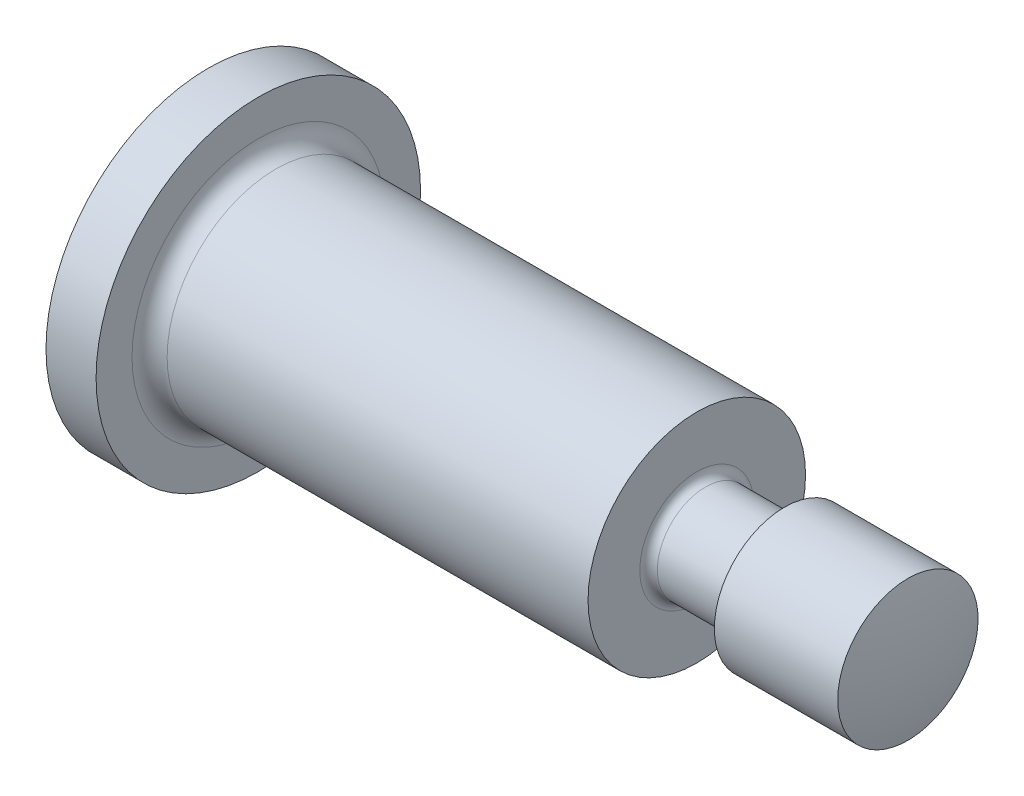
from build123d import *

# Parameters (mm, degrees)
SKETCH1_R       = 1.85
BASEHEAD_DEPTH  = 1.1
SKETCH2_R       = 1.24
BASEBODY_DEPTH  = 5
SKETCH3_R       = 0.8
BASEEND_DEPTH   = 2.5
SKETCH4_W       = 5
SKETCH4_H       = 1
FILLET1_R       = 0.1
SLOT_DEPTH      = 11.000749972
SLOT_DEPTH_BACK = 11.000749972
SKETCH5_W       = 0.5
SKETCH5_H       = 0.5
HEADFILLET_R    = 0.2


with BuildPart() as part:
    # Sketch1 → BaseHead (new body)
    with BuildSketch(Plane(origin=(0, 0, 0), x_dir=(0, 0, -1), z_dir=(1, 0, 0))):
        Circle(SKETCH1_R)
    extrude(amount=BASEHEAD_DEPTH)

    # Sketch2 → BaseBody (add)
    with BuildSketch(Plane(origin=(1.1, -0.609134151, 0.454793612), x_dir=(0, 0, -1), z_dir=(1, 0, 0))):
        with Locations((0.454793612, 0.609134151)):
            Circle(SKETCH2_R)
    extrude(amount=BASEBODY_DEPTH)

    # Sketch3 → BaseEnd (add)
    with BuildSketch(Plane(origin=(6.1, 0.539141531, 0.193652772), x_dir=(0, 0, -1), z_dir=(1, 0, 0))):
        with Locations((0.193652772, -0.539141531)):
            Circle(SKETCH3_R)
    extrude(amount=BASEEND_DEPTH)

    # Sketch4 → Cut-Revolve2 (revolve, cut)
    with BuildSketch(Plane(origin=(-6.100035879, 0.550035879, 0), x_dir=(0, -1, 0), z_dir=(0, 0, 1))):
        with Locations((-2.499964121, 12.70003588)):
            Rectangle(SKETCH4_W, SKETCH4_H)
    revolve(axis=Axis((2.427994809, 0, 0), (-1, 0, 0)), mode=Mode.SUBTRACT)

    # Fillet1
    fillet1_edges = [part.edges().sort_by_distance(p)[0] for p in [
        (6.1, -0.55, 0),
        (7.1, -0.55, 0),
    ]]
    fillet(fillet1_edges, radius=FILLET1_R)

    # Sketch5 → Slot (cut, two sides: drawn at the far end of the back side and taken through both)
    with BuildSketch(Plane(origin=(-0.85, -0.85, 0), x_dir=(0, 1, 0), z_dir=(0, 0, 1)).offset(-SLOT_DEPTH_BACK)):
        with Locations((0.85, -1.1)):
            Rectangle(SKETCH5_W, SKETCH5_H)
    extrude(amount=SLOT_DEPTH + SLOT_DEPTH_BACK, mode=Mode.SUBTRACT)

    # Sketch6 → BaseTop (revolve, cut)
    with BuildSketch(Plane(origin=(-7.588764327, 2.088764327, 0), x_dir=(0, -1, 0), z_dir=(0, 0, 1))):
        with BuildLine():
            Line((-1.411235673, 12.688764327), (-3.411235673, 12.688764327))
            Line((-3.411235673, 12.688764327), (-3.411235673, 18.188764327))
            Line((-3.411235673, 18.188764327), (2.088764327, 18.188764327))
            Line((2.088764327, 18.188764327), (2.088764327, 16.188764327))
            ThreePointArc((2.088764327, 16.188764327), (-0.386109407, 15.163638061), (-1.411235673, 12.688764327))
        make_face()
        with BuildLine():
            Line((0.238764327, 5.588764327), (2.088764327, 5.588764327))
            Line((2.088764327, 5.588764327), (2.088764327, 7.588764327))
            ThreePointArc((2.088764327, 7.588764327), (1.126706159, 7.723583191), (0.238764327, 8.117653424))
            Line((0.238764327, 8.117653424), (0.238764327, 5.588764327))
        make_face()
    revolve(axis=Axis((5.660097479, 0, 0), (-1, 0, 0)), mode=Mode.SUBTRACT)

    # HeadFillet
    headfillet_edges = [part.edges().sort_by_distance(p)[0] for p in [
        (1.1, 0, 1.24),
    ]]
    fillet(headfillet_edges, radius=HEADFILLET_R)


solid = part.part
